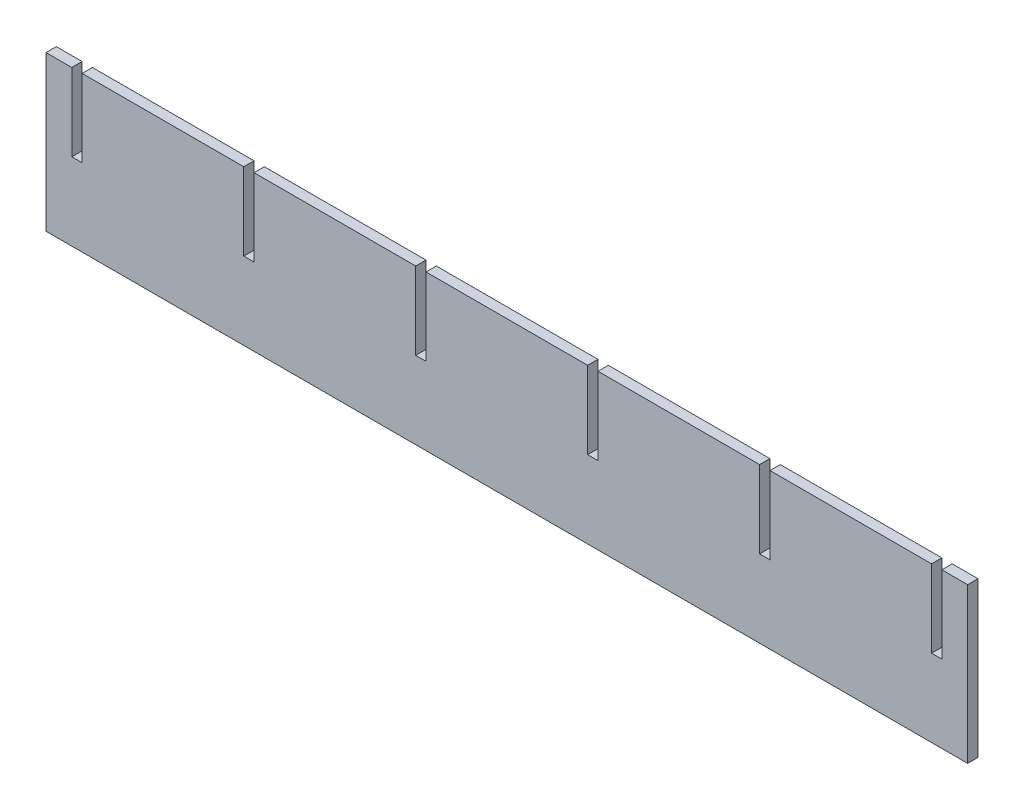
from build123d import *

# Parameters (mm, degrees)
BOSS_EXTRUDE1_DEPTH = 12


with BuildPart() as part:
    # Sketch3 → Boss-Extrude1 (new body)
    with BuildSketch(Plane(origin=(0, 0, 0), x_dir=(0, 1, 0), z_dir=(0, 0, 1))):
        Polygon((0, -294), (90, -294), (90, -106), (0, -106), (0, -94), (90, -94), (90, 94), (0, 94), (0, 106), (90, 106), (90, 294), (0, 294), (0, 306), (90, 306), (90, 494), (0, 494), (0, 506), (90, 506), (90, 536), (-90, 536), (-90, -536), (90, -536), (90, -506), (0, -506), (0, -494), (90, -494), (90, -306), (0, -306), align=None)
    extrude(amount=BOSS_EXTRUDE1_DEPTH)


solid = part.part
